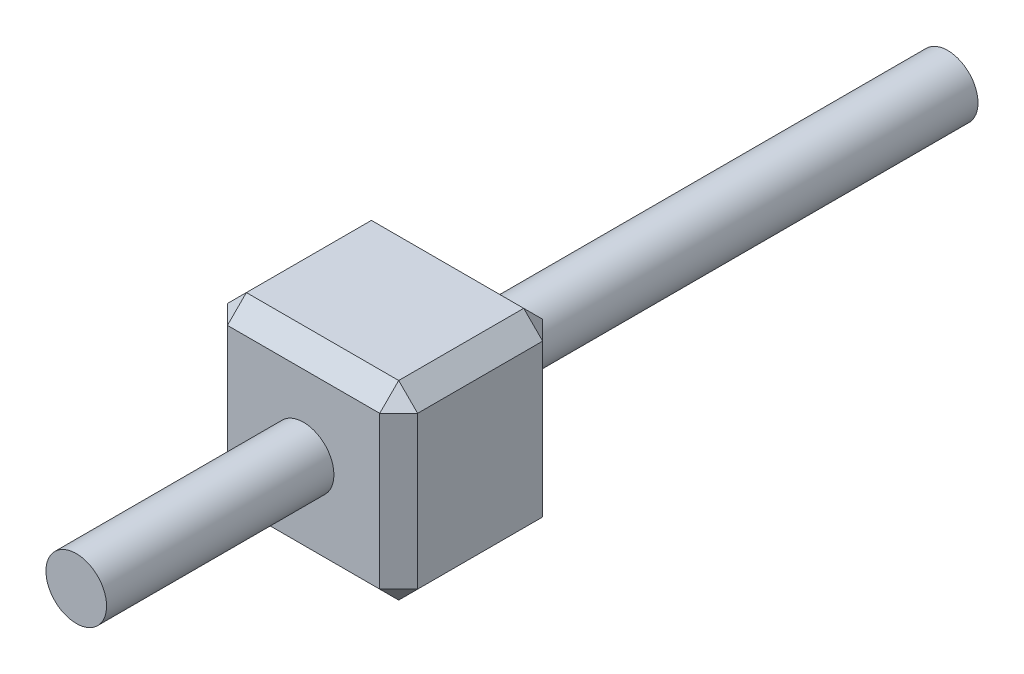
ISO-10303-21;
HEADER;
FILE_DESCRIPTION(('STEP AP214'),'2;1');
FILE_NAME('part.step','',(''),(''),'','','');
FILE_SCHEMA(('AUTOMOTIVE_DESIGN { 1 0 10303 214 1 1 1 1 }'));
ENDSEC;
DATA;
#1=APPLICATION_CONTEXT('core data for automotive mechanical design processes');
#2=APPLICATION_PROTOCOL_DEFINITION('international standard','automotive_design',2000,#1);
#3=PRODUCT_CONTEXT('',#1,'mechanical');
#4=PRODUCT('Part','Part','',(#3));
#5=PRODUCT_RELATED_PRODUCT_CATEGORY('part','',(#4));
#6=PRODUCT_DEFINITION_FORMATION('','',#4);
#7=PRODUCT_DEFINITION_CONTEXT('part definition',#1,'design');
#8=PRODUCT_DEFINITION('design','',#6,#7);
#9=PRODUCT_DEFINITION_SHAPE('','',#8);
#10=(LENGTH_UNIT() NAMED_UNIT(*) SI_UNIT(.MILLI.,.METRE.));
#11=(NAMED_UNIT(*) PLANE_ANGLE_UNIT() SI_UNIT($,.RADIAN.));
#12=(NAMED_UNIT(*) SI_UNIT($,.STERADIAN.) SOLID_ANGLE_UNIT());
#13=UNCERTAINTY_MEASURE_WITH_UNIT(LENGTH_MEASURE(1.E-05),#10,'distance_accuracy_value','');
#14=(GEOMETRIC_REPRESENTATION_CONTEXT(3) GLOBAL_UNCERTAINTY_ASSIGNED_CONTEXT((#13)) GLOBAL_UNIT_ASSIGNED_CONTEXT((#10,
#11,#12)) REPRESENTATION_CONTEXT('',''));
#15=CARTESIAN_POINT('',(0.,0.,0.));
#16=DIRECTION('',(0.,0.,1.));
#17=DIRECTION('',(1.,0.,0.));
#18=AXIS2_PLACEMENT_3D('',#15,#16,#17);
#19=CARTESIAN_POINT('',(-30.5004152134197,21.8097143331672,2.15));
#20=DIRECTION('',(0.,0.,1.));
#21=DIRECTION('',(1.,0.,0.));
#22=AXIS2_PLACEMENT_3D('',#19,#20,#21);
#23=PLANE('',#22);
#24=DIRECTION('',(-1.,0.,0.));
#25=VECTOR('',#24,1.);
#26=CARTESIAN_POINT('',(-30.5004152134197,24.0697143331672,2.15));
#27=LINE('',#26,#25);
#28=CARTESIAN_POINT('',(-28.2404152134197,24.0697143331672,2.15));
#29=VERTEX_POINT('',#28);
#30=CARTESIAN_POINT('',(-30.2504152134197,24.0697143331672,2.15));
#31=VERTEX_POINT('',#30);
#32=EDGE_CURVE('E123',#29,#31,#27,.T.);
#33=ORIENTED_EDGE('',*,*,#32,.T.);
#34=DIRECTION('',(0.,-1.,0.));
#35=VECTOR('',#34,1.);
#36=CARTESIAN_POINT('',(-30.2504152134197,21.8097143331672,2.15));
#37=LINE('',#36,#35);
#38=CARTESIAN_POINT('',(-30.2504152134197,22.0597143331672,2.15));
#39=VERTEX_POINT('',#38);
#40=EDGE_CURVE('E162',#31,#39,#37,.T.);
#41=ORIENTED_EDGE('',*,*,#40,.T.);
#42=DIRECTION('',(1.,0.,0.));
#43=VECTOR('',#42,1.);
#44=CARTESIAN_POINT('',(-27.9904152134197,22.0597143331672,2.15));
#45=LINE('',#44,#43);
#46=CARTESIAN_POINT('',(-28.2404152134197,22.0597143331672,2.15));
#47=VERTEX_POINT('',#46);
#48=EDGE_CURVE('E126',#39,#47,#45,.T.);
#49=ORIENTED_EDGE('',*,*,#48,.T.);
#50=DIRECTION('',(0.,1.,0.));
#51=VECTOR('',#50,1.);
#52=CARTESIAN_POINT('',(-28.2404152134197,24.3197143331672,2.15));
#53=LINE('',#52,#51);
#54=EDGE_CURVE('E118',#47,#29,#53,.T.);
#55=ORIENTED_EDGE('',*,*,#54,.T.);
#56=EDGE_LOOP('',(#33,#41,#49,#55));
#57=FACE_BOUND('',#56,.T.);
#58=CARTESIAN_POINT('',(-29.2454152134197,23.0647143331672,2.15));
#59=DIRECTION('',(0.,0.,1.));
#60=DIRECTION('',(1.,0.,0.));
#61=AXIS2_PLACEMENT_3D('',#58,#59,#60);
#62=CIRCLE('',#61,0.400000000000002);
#63=CARTESIAN_POINT('',(-28.8454152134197,23.0647143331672,2.15));
#64=VERTEX_POINT('',#63);
#65=EDGE_CURVE('E157',#64,#64,#62,.F.);
#66=ORIENTED_EDGE('',*,*,#65,.T.);
#67=EDGE_LOOP('',(#66));
#68=FACE_BOUND('',#67,.T.);
#69=ADVANCED_FACE('F33',(#57,#68),#23,.T.);
#70=CARTESIAN_POINT('',(-30.5004152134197,21.8097143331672,0.));
#71=DIRECTION('',(0.,0.,1.));
#72=DIRECTION('',(1.,0.,0.));
#73=AXIS2_PLACEMENT_3D('',#70,#71,#72);
#74=PLANE('',#73);
#75=DIRECTION('',(-1.,0.,0.));
#76=VECTOR('',#75,1.);
#77=CARTESIAN_POINT('',(-30.5004152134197,22.0597143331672,0.));
#78=LINE('',#77,#76);
#79=CARTESIAN_POINT('',(-28.2404152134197,22.0597143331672,0.));
#80=VERTEX_POINT('',#79);
#81=CARTESIAN_POINT('',(-30.2504152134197,22.0597143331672,0.));
#82=VERTEX_POINT('',#81);
#83=EDGE_CURVE('E177',#80,#82,#78,.T.);
#84=ORIENTED_EDGE('',*,*,#83,.T.);
#85=DIRECTION('',(0.,1.,0.));
#86=VECTOR('',#85,1.);
#87=CARTESIAN_POINT('',(-30.2504152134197,21.8097143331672,0.));
#88=LINE('',#87,#86);
#89=CARTESIAN_POINT('',(-30.2504152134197,24.0697143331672,0.));
#90=VERTEX_POINT('',#89);
#91=EDGE_CURVE('E179',#82,#90,#88,.T.);
#92=ORIENTED_EDGE('',*,*,#91,.T.);
#93=DIRECTION('',(1.,0.,0.));
#94=VECTOR('',#93,1.);
#95=CARTESIAN_POINT('',(-30.5004152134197,24.0697143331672,0.));
#96=LINE('',#95,#94);
#97=CARTESIAN_POINT('',(-28.2404152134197,24.0697143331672,0.));
#98=VERTEX_POINT('',#97);
#99=EDGE_CURVE('E173',#90,#98,#96,.T.);
#100=ORIENTED_EDGE('',*,*,#99,.T.);
#101=DIRECTION('',(0.,-1.,0.));
#102=VECTOR('',#101,1.);
#103=CARTESIAN_POINT('',(-28.2404152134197,21.8097143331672,0.));
#104=LINE('',#103,#102);
#105=EDGE_CURVE('E175',#98,#80,#104,.T.);
#106=ORIENTED_EDGE('',*,*,#105,.T.);
#107=EDGE_LOOP('',(#84,#92,#100,#106));
#108=FACE_BOUND('',#107,.T.);
#109=CARTESIAN_POINT('',(-29.2454152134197,23.0647143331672,0.));
#110=DIRECTION('',(0.,0.,1.));
#111=DIRECTION('',(1.,0.,0.));
#112=AXIS2_PLACEMENT_3D('',#109,#110,#111);
#113=CIRCLE('',#112,0.400000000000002);
#114=CARTESIAN_POINT('',(-28.8454152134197,23.0647143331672,0.));
#115=VERTEX_POINT('',#114);
#116=EDGE_CURVE('E154',#115,#115,#113,.F.);
#117=ORIENTED_EDGE('',*,*,#116,.F.);
#118=EDGE_LOOP('',(#117));
#119=FACE_BOUND('',#118,.T.);
#120=ADVANCED_FACE('F295',(#108,#119),#74,.F.);
#121=CARTESIAN_POINT('',(-30.5004152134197,24.3197143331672,2.15));
#122=DIRECTION('',(1.,0.,0.));
#123=DIRECTION('',(0.,0.,-1.));
#124=AXIS2_PLACEMENT_3D('',#121,#122,#123);
#125=PLANE('',#124);
#126=DIRECTION('',(0.,-1.,0.));
#127=VECTOR('',#126,1.);
#128=CARTESIAN_POINT('',(-30.5004152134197,24.3197143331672,0.25));
#129=LINE('',#128,#127);
#130=CARTESIAN_POINT('',(-30.5004152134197,24.0697143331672,0.25));
#131=VERTEX_POINT('',#130);
#132=CARTESIAN_POINT('',(-30.5004152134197,22.0597143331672,0.25));
#133=VERTEX_POINT('',#132);
#134=EDGE_CURVE('E166',#131,#133,#129,.T.);
#135=ORIENTED_EDGE('',*,*,#134,.T.);
#136=DIRECTION('',(0.,0.,1.));
#137=VECTOR('',#136,1.);
#138=CARTESIAN_POINT('',(-30.5004152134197,22.0597143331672,2.15));
#139=LINE('',#138,#137);
#140=CARTESIAN_POINT('',(-30.5004152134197,22.0597143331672,1.9));
#141=VERTEX_POINT('',#140);
#142=EDGE_CURVE('E171',#133,#141,#139,.T.);
#143=ORIENTED_EDGE('',*,*,#142,.T.);
#144=DIRECTION('',(0.,1.,0.));
#145=VECTOR('',#144,1.);
#146=CARTESIAN_POINT('',(-30.5004152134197,24.3197143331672,1.9));
#147=LINE('',#146,#145);
#148=CARTESIAN_POINT('',(-30.5004152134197,24.0697143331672,1.9));
#149=VERTEX_POINT('',#148);
#150=EDGE_CURVE('E168',#141,#149,#147,.T.);
#151=ORIENTED_EDGE('',*,*,#150,.T.);
#152=DIRECTION('',(0.,0.,-1.));
#153=VECTOR('',#152,1.);
#154=CARTESIAN_POINT('',(-30.5004152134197,24.0697143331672,2.15));
#155=LINE('',#154,#153);
#156=EDGE_CURVE('E164',#149,#131,#155,.T.);
#157=ORIENTED_EDGE('',*,*,#156,.T.);
#158=EDGE_LOOP('',(#135,#143,#151,#157));
#159=FACE_BOUND('',#158,.T.);
#160=ADVANCED_FACE('F35',(#159),#125,.F.);
#161=CARTESIAN_POINT('',(-30.5004152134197,21.8097143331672,2.15));
#162=DIRECTION('',(0.,1.,0.));
#163=DIRECTION('',(0.,0.,1.));
#164=AXIS2_PLACEMENT_3D('',#161,#162,#163);
#165=PLANE('',#164);
#166=DIRECTION('',(-1.,0.,0.));
#167=VECTOR('',#166,1.);
#168=CARTESIAN_POINT('',(-30.5004152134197,21.8097143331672,1.9));
#169=LINE('',#168,#167);
#170=CARTESIAN_POINT('',(-28.2404152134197,21.8097143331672,1.9));
#171=VERTEX_POINT('',#170);
#172=CARTESIAN_POINT('',(-30.2504152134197,21.8097143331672,1.9));
#173=VERTEX_POINT('',#172);
#174=EDGE_CURVE('E186',#171,#173,#169,.T.);
#175=ORIENTED_EDGE('',*,*,#174,.T.);
#176=DIRECTION('',(0.,0.,-1.));
#177=VECTOR('',#176,1.);
#178=CARTESIAN_POINT('',(-30.2504152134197,21.8097143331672,2.15));
#179=LINE('',#178,#177);
#180=CARTESIAN_POINT('',(-30.2504152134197,21.8097143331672,0.25));
#181=VERTEX_POINT('',#180);
#182=EDGE_CURVE('E188',#173,#181,#179,.T.);
#183=ORIENTED_EDGE('',*,*,#182,.T.);
#184=DIRECTION('',(1.,0.,0.));
#185=VECTOR('',#184,1.);
#186=CARTESIAN_POINT('',(-30.5004152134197,21.8097143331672,0.25));
#187=LINE('',#186,#185);
#188=CARTESIAN_POINT('',(-28.2404152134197,21.8097143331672,0.25));
#189=VERTEX_POINT('',#188);
#190=EDGE_CURVE('E184',#181,#189,#187,.T.);
#191=ORIENTED_EDGE('',*,*,#190,.T.);
#192=DIRECTION('',(0.,0.,1.));
#193=VECTOR('',#192,1.);
#194=CARTESIAN_POINT('',(-28.2404152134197,21.8097143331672,2.15));
#195=LINE('',#194,#193);
#196=EDGE_CURVE('E182',#189,#171,#195,.T.);
#197=ORIENTED_EDGE('',*,*,#196,.T.);
#198=EDGE_LOOP('',(#175,#183,#191,#197));
#199=FACE_BOUND('',#198,.T.);
#200=ADVANCED_FACE('F308',(#199),#165,.F.);
#201=CARTESIAN_POINT('',(-27.9904152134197,24.3197143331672,2.15));
#202=DIRECTION('',(-1.,0.,0.));
#203=DIRECTION('',(0.,-1.,0.));
#204=AXIS2_PLACEMENT_3D('',#201,#202,#203);
#205=PLANE('',#204);
#206=DIRECTION('',(0.,-1.,0.));
#207=VECTOR('',#206,1.);
#208=CARTESIAN_POINT('',(-27.9904152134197,21.8097143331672,1.9));
#209=LINE('',#208,#207);
#210=CARTESIAN_POINT('',(-27.9904152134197,24.0697143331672,1.9));
#211=VERTEX_POINT('',#210);
#212=CARTESIAN_POINT('',(-27.9904152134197,22.0597143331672,1.9));
#213=VERTEX_POINT('',#212);
#214=EDGE_CURVE('E136',#211,#213,#209,.T.);
#215=ORIENTED_EDGE('',*,*,#214,.T.);
#216=DIRECTION('',(0.,0.,-1.));
#217=VECTOR('',#216,1.);
#218=CARTESIAN_POINT('',(-27.9904152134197,22.0597143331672,2.15));
#219=LINE('',#218,#217);
#220=CARTESIAN_POINT('',(-27.9904152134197,22.0597143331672,0.25));
#221=VERTEX_POINT('',#220);
#222=EDGE_CURVE('E196',#213,#221,#219,.T.);
#223=ORIENTED_EDGE('',*,*,#222,.T.);
#224=DIRECTION('',(0.,1.,0.));
#225=VECTOR('',#224,1.);
#226=CARTESIAN_POINT('',(-27.9904152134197,24.3197143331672,0.25));
#227=LINE('',#226,#225);
#228=CARTESIAN_POINT('',(-27.9904152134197,24.0697143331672,0.25));
#229=VERTEX_POINT('',#228);
#230=EDGE_CURVE('E193',#221,#229,#227,.T.);
#231=ORIENTED_EDGE('',*,*,#230,.T.);
#232=DIRECTION('',(0.,0.,1.));
#233=VECTOR('',#232,1.);
#234=CARTESIAN_POINT('',(-27.9904152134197,24.0697143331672,2.15));
#235=LINE('',#234,#233);
#236=EDGE_CURVE('E191',#229,#211,#235,.T.);
#237=ORIENTED_EDGE('',*,*,#236,.T.);
#238=EDGE_LOOP('',(#215,#223,#231,#237));
#239=FACE_BOUND('',#238,.T.);
#240=ADVANCED_FACE('F306',(#239),#205,.F.);
#241=CARTESIAN_POINT('',(-30.5004152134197,24.3197143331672,2.15));
#242=DIRECTION('',(0.,-1.,0.));
#243=DIRECTION('',(0.,0.,-1.));
#244=AXIS2_PLACEMENT_3D('',#241,#242,#243);
#245=PLANE('',#244);
#246=DIRECTION('',(1.,0.,0.));
#247=VECTOR('',#246,1.);
#248=CARTESIAN_POINT('',(-27.9904152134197,24.3197143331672,1.9));
#249=LINE('',#248,#247);
#250=CARTESIAN_POINT('',(-30.2504152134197,24.3197143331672,1.9));
#251=VERTEX_POINT('',#250);
#252=CARTESIAN_POINT('',(-28.2404152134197,24.3197143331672,1.9));
#253=VERTEX_POINT('',#252);
#254=EDGE_CURVE('E41',#251,#253,#249,.T.);
#255=ORIENTED_EDGE('',*,*,#254,.T.);
#256=DIRECTION('',(0.,0.,-1.));
#257=VECTOR('',#256,1.);
#258=CARTESIAN_POINT('',(-28.2404152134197,24.3197143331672,2.15));
#259=LINE('',#258,#257);
#260=CARTESIAN_POINT('',(-28.2404152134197,24.3197143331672,0.25));
#261=VERTEX_POINT('',#260);
#262=EDGE_CURVE('E11',#253,#261,#259,.T.);
#263=ORIENTED_EDGE('',*,*,#262,.T.);
#264=DIRECTION('',(-1.,0.,0.));
#265=VECTOR('',#264,1.);
#266=CARTESIAN_POINT('',(-30.5004152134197,24.3197143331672,0.25));
#267=LINE('',#266,#265);
#268=CARTESIAN_POINT('',(-30.2504152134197,24.3197143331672,0.25));
#269=VERTEX_POINT('',#268);
#270=EDGE_CURVE('E199',#261,#269,#267,.T.);
#271=ORIENTED_EDGE('',*,*,#270,.T.);
#272=DIRECTION('',(0.,0.,1.));
#273=VECTOR('',#272,1.);
#274=CARTESIAN_POINT('',(-30.2504152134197,24.3197143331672,2.15));
#275=LINE('',#274,#273);
#276=EDGE_CURVE('E51',#269,#251,#275,.T.);
#277=ORIENTED_EDGE('',*,*,#276,.T.);
#278=EDGE_LOOP('',(#255,#263,#271,#277));
#279=FACE_BOUND('',#278,.T.);
#280=ADVANCED_FACE('F202',(#279),#245,.F.);
#281=CARTESIAN_POINT('',(-29.2454152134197,23.0647143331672,-6.35));
#282=DIRECTION('',(0.,0.,1.));
#283=DIRECTION('',(1.,0.,0.));
#284=AXIS2_PLACEMENT_3D('',#281,#282,#283);
#285=PLANE('',#284);
#286=CARTESIAN_POINT('',(-29.2454152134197,23.0647143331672,-6.35));
#287=DIRECTION('',(0.,0.,1.));
#288=DIRECTION('',(1.,0.,0.));
#289=AXIS2_PLACEMENT_3D('',#286,#287,#288);
#290=CIRCLE('',#289,0.400000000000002);
#291=CARTESIAN_POINT('',(-28.8454152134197,23.0647143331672,-6.35));
#292=VERTEX_POINT('',#291);
#293=EDGE_CURVE('E268',#292,#292,#290,.T.);
#294=ORIENTED_EDGE('',*,*,#293,.F.);
#295=EDGE_LOOP('',(#294));
#296=FACE_BOUND('',#295,.T.);
#297=ADVANCED_FACE('F305',(#296),#285,.F.);
#298=CARTESIAN_POINT('',(-29.2454152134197,23.0647143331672,5.15));
#299=DIRECTION('',(0.,0.,-1.));
#300=DIRECTION('',(-1.,0.,0.));
#301=AXIS2_PLACEMENT_3D('',#298,#299,#300);
#302=CYLINDRICAL_SURFACE('',#301,0.400000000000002);
#303=ORIENTED_EDGE('',*,*,#293,.T.);
#304=EDGE_LOOP('',(#303));
#305=FACE_BOUND('',#304,.T.);
#306=ORIENTED_EDGE('',*,*,#116,.T.);
#307=EDGE_LOOP('',(#306));
#308=FACE_BOUND('',#307,.T.);
#309=ADVANCED_FACE('F280',(#305,#308),#302,.T.);
#310=ORIENTED_EDGE('',*,*,#65,.F.);
#311=EDGE_LOOP('',(#310));
#312=FACE_BOUND('',#311,.T.);
#313=CARTESIAN_POINT('',(-29.2454152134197,23.0647143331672,5.15));
#314=DIRECTION('',(0.,0.,1.));
#315=DIRECTION('',(1.,0.,0.));
#316=AXIS2_PLACEMENT_3D('',#313,#314,#315);
#317=CIRCLE('',#316,0.400000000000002);
#318=CARTESIAN_POINT('',(-28.8454152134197,23.0647143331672,5.15));
#319=VERTEX_POINT('',#318);
#320=EDGE_CURVE('E271',#319,#319,#317,.T.);
#321=ORIENTED_EDGE('',*,*,#320,.F.);
#322=EDGE_LOOP('',(#321));
#323=FACE_BOUND('',#322,.T.);
#324=ADVANCED_FACE('F276',(#312,#323),#302,.T.);
#325=CARTESIAN_POINT('',(-29.2454152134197,23.0647143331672,5.15));
#326=DIRECTION('',(0.,0.,1.));
#327=DIRECTION('',(1.,0.,0.));
#328=AXIS2_PLACEMENT_3D('',#325,#326,#327);
#329=PLANE('',#328);
#330=ORIENTED_EDGE('',*,*,#320,.T.);
#331=EDGE_LOOP('',(#330));
#332=FACE_BOUND('',#331,.T.);
#333=ADVANCED_FACE('F279',(#332),#329,.T.);
#334=CARTESIAN_POINT('',(-27.9904152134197,24.3197143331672,0.25));
#335=DIRECTION('',(-0.707106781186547,0.,0.707106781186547));
#336=DIRECTION('',(0.707106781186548,0.,0.707106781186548));
#337=AXIS2_PLACEMENT_3D('',#334,#335,#336);
#338=PLANE('',#337);
#339=DIRECTION('',(0.707106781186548,0.,0.707106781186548));
#340=VECTOR('',#339,1.);
#341=CARTESIAN_POINT('',(-27.9904152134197,24.0697143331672,0.25));
#342=LINE('',#341,#340);
#343=EDGE_CURVE('E265',#229,#98,#342,.F.);
#344=ORIENTED_EDGE('',*,*,#343,.F.);
#345=ORIENTED_EDGE('',*,*,#230,.F.);
#346=DIRECTION('',(-0.707106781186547,0.,-0.707106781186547));
#347=VECTOR('',#346,1.);
#348=CARTESIAN_POINT('',(-28.1154152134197,22.0597143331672,0.125));
#349=LINE('',#348,#347);
#350=EDGE_CURVE('E262',#80,#221,#349,.F.);
#351=ORIENTED_EDGE('',*,*,#350,.F.);
#352=ORIENTED_EDGE('',*,*,#105,.F.);
#353=EDGE_LOOP('',(#344,#345,#351,#352));
#354=FACE_BOUND('',#353,.T.);
#355=ADVANCED_FACE('F285',(#354),#338,.F.);
#356=CARTESIAN_POINT('',(-27.9904152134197,24.0697143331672,0.25));
#357=DIRECTION('',(0.577350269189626,0.577350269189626,-0.577350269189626));
#358=DIRECTION('',(-0.707106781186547,0.,-0.707106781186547));
#359=AXIS2_PLACEMENT_3D('',#356,#357,#358);
#360=PLANE('',#359);
#361=DIRECTION('',(-0.707106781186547,0.707106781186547,0.));
#362=VECTOR('',#361,1.);
#363=CARTESIAN_POINT('',(-27.9904152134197,24.0697143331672,0.25));
#364=LINE('',#363,#362);
#365=EDGE_CURVE('E257',#229,#261,#364,.T.);
#366=ORIENTED_EDGE('',*,*,#365,.F.);
#367=ORIENTED_EDGE('',*,*,#343,.T.);
#368=DIRECTION('',(0.,-0.707106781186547,-0.707106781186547));
#369=VECTOR('',#368,1.);
#370=CARTESIAN_POINT('',(-28.2404152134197,24.1947143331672,0.125));
#371=LINE('',#370,#369);
#372=EDGE_CURVE('E260',#261,#98,#371,.T.);
#373=ORIENTED_EDGE('',*,*,#372,.F.);
#374=EDGE_LOOP('',(#366,#367,#373));
#375=FACE_BOUND('',#374,.T.);
#376=ADVANCED_FACE('F290',(#375),#360,.T.);
#377=CARTESIAN_POINT('',(-28.2404152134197,21.8097143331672,0.25));
#378=DIRECTION('',(0.577350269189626,-0.577350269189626,-0.577350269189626));
#379=DIRECTION('',(-0.707106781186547,0.,-0.707106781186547));
#380=AXIS2_PLACEMENT_3D('',#377,#378,#379);
#381=PLANE('',#380);
#382=DIRECTION('',(0.,-0.707106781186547,0.707106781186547));
#383=VECTOR('',#382,1.);
#384=CARTESIAN_POINT('',(-28.2404152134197,21.8097143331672,0.25));
#385=LINE('',#384,#383);
#386=EDGE_CURVE('E252',#80,#189,#385,.T.);
#387=ORIENTED_EDGE('',*,*,#386,.F.);
#388=ORIENTED_EDGE('',*,*,#350,.T.);
#389=DIRECTION('',(0.707106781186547,0.707106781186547,0.));
#390=VECTOR('',#389,1.);
#391=CARTESIAN_POINT('',(-28.2404152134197,21.8097143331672,0.25));
#392=LINE('',#391,#390);
#393=EDGE_CURVE('E255',#189,#221,#392,.T.);
#394=ORIENTED_EDGE('',*,*,#393,.F.);
#395=EDGE_LOOP('',(#387,#388,#394));
#396=FACE_BOUND('',#395,.T.);
#397=ADVANCED_FACE('F353',(#396),#381,.T.);
#398=CARTESIAN_POINT('',(-30.5004152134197,24.3197143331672,0.25));
#399=DIRECTION('',(0.,-0.707106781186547,0.707106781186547));
#400=DIRECTION('',(0.,-0.707106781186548,-0.707106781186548));
#401=AXIS2_PLACEMENT_3D('',#398,#399,#400);
#402=PLANE('',#401);
#403=ORIENTED_EDGE('',*,*,#372,.T.);
#404=ORIENTED_EDGE('',*,*,#99,.F.);
#405=DIRECTION('',(0.,0.707106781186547,0.707106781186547));
#406=VECTOR('',#405,1.);
#407=CARTESIAN_POINT('',(-30.2504152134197,24.0697143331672,0.));
#408=LINE('',#407,#406);
#409=EDGE_CURVE('E207',#269,#90,#408,.F.);
#410=ORIENTED_EDGE('',*,*,#409,.F.);
#411=ORIENTED_EDGE('',*,*,#270,.F.);
#412=EDGE_LOOP('',(#403,#404,#410,#411));
#413=FACE_BOUND('',#412,.T.);
#414=ADVANCED_FACE('F209',(#413),#402,.F.);
#415=CARTESIAN_POINT('',(-28.2404152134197,24.3197143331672,2.15));
#416=DIRECTION('',(-0.707106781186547,-0.707106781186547,0.));
#417=DIRECTION('',(0.707106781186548,-0.707106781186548,0.));
#418=AXIS2_PLACEMENT_3D('',#415,#416,#417);
#419=PLANE('',#418);
#420=ORIENTED_EDGE('',*,*,#365,.T.);
#421=ORIENTED_EDGE('',*,*,#262,.F.);
#422=DIRECTION('',(0.707106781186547,-0.707106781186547,0.));
#423=VECTOR('',#422,1.);
#424=CARTESIAN_POINT('',(-28.1154152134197,24.1947143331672,1.9));
#425=LINE('',#424,#423);
#426=EDGE_CURVE('E140',#211,#253,#425,.F.);
#427=ORIENTED_EDGE('',*,*,#426,.F.);
#428=ORIENTED_EDGE('',*,*,#236,.F.);
#429=EDGE_LOOP('',(#420,#421,#427,#428));
#430=FACE_BOUND('',#429,.T.);
#431=ADVANCED_FACE('F382',(#430),#419,.F.);
#432=CARTESIAN_POINT('',(-28.2404152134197,21.8097143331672,2.15));
#433=DIRECTION('',(0.707106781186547,0.,0.707106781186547));
#434=DIRECTION('',(0.707106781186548,0.,-0.707106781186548));
#435=AXIS2_PLACEMENT_3D('',#432,#433,#434);
#436=PLANE('',#435);
#437=DIRECTION('',(-0.707106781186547,0.,0.707106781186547));
#438=VECTOR('',#437,1.);
#439=CARTESIAN_POINT('',(-28.2404152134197,22.0597143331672,2.15));
#440=LINE('',#439,#438);
#441=EDGE_CURVE('E141',#213,#47,#440,.T.);
#442=ORIENTED_EDGE('',*,*,#441,.F.);
#443=ORIENTED_EDGE('',*,*,#214,.F.);
#444=DIRECTION('',(0.707106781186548,0.,-0.707106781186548));
#445=VECTOR('',#444,1.);
#446=CARTESIAN_POINT('',(-28.2404152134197,24.0697143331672,2.15));
#447=LINE('',#446,#445);
#448=EDGE_CURVE('E133',#29,#211,#447,.T.);
#449=ORIENTED_EDGE('',*,*,#448,.F.);
#450=ORIENTED_EDGE('',*,*,#54,.F.);
#451=EDGE_LOOP('',(#442,#443,#449,#450));
#452=FACE_BOUND('',#451,.T.);
#453=ADVANCED_FACE('F135',(#452),#436,.T.);
#454=CARTESIAN_POINT('',(-27.9904152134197,22.0597143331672,2.15));
#455=DIRECTION('',(-0.707106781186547,0.707106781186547,0.));
#456=DIRECTION('',(-0.707106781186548,-0.707106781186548,0.));
#457=AXIS2_PLACEMENT_3D('',#454,#455,#456);
#458=PLANE('',#457);
#459=ORIENTED_EDGE('',*,*,#393,.T.);
#460=ORIENTED_EDGE('',*,*,#222,.F.);
#461=DIRECTION('',(-0.707106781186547,-0.707106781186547,0.));
#462=VECTOR('',#461,1.);
#463=CARTESIAN_POINT('',(-28.1154152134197,21.9347143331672,1.9));
#464=LINE('',#463,#462);
#465=EDGE_CURVE('E246',#171,#213,#464,.F.);
#466=ORIENTED_EDGE('',*,*,#465,.F.);
#467=ORIENTED_EDGE('',*,*,#196,.F.);
#468=EDGE_LOOP('',(#459,#460,#466,#467));
#469=FACE_BOUND('',#468,.T.);
#470=ADVANCED_FACE('F358',(#469),#458,.F.);
#471=CARTESIAN_POINT('',(-30.5004152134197,21.8097143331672,0.25));
#472=DIRECTION('',(0.,0.707106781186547,0.707106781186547));
#473=DIRECTION('',(0.,-0.707106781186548,0.707106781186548));
#474=AXIS2_PLACEMENT_3D('',#471,#472,#473);
#475=PLANE('',#474);
#476=ORIENTED_EDGE('',*,*,#386,.T.);
#477=ORIENTED_EDGE('',*,*,#190,.F.);
#478=DIRECTION('',(0.,0.707106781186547,-0.707106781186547));
#479=VECTOR('',#478,1.);
#480=CARTESIAN_POINT('',(-30.2504152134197,21.9347143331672,0.125));
#481=LINE('',#480,#479);
#482=EDGE_CURVE('E243',#82,#181,#481,.F.);
#483=ORIENTED_EDGE('',*,*,#482,.F.);
#484=ORIENTED_EDGE('',*,*,#83,.F.);
#485=EDGE_LOOP('',(#476,#477,#483,#484));
#486=FACE_BOUND('',#485,.T.);
#487=ADVANCED_FACE('F349',(#486),#475,.F.);
#488=CARTESIAN_POINT('',(-30.5004152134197,24.3197143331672,0.25));
#489=DIRECTION('',(0.707106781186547,0.,0.707106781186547));
#490=DIRECTION('',(0.707106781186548,0.,-0.707106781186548));
#491=AXIS2_PLACEMENT_3D('',#488,#489,#490);
#492=PLANE('',#491);
#493=DIRECTION('',(0.707106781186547,0.,-0.707106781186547));
#494=VECTOR('',#493,1.);
#495=CARTESIAN_POINT('',(-30.2504152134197,24.0697143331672,0.));
#496=LINE('',#495,#494);
#497=EDGE_CURVE('E213',#90,#131,#496,.F.);
#498=ORIENTED_EDGE('',*,*,#497,.F.);
#499=ORIENTED_EDGE('',*,*,#91,.F.);
#500=DIRECTION('',(-0.707106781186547,0.,0.707106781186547));
#501=VECTOR('',#500,1.);
#502=CARTESIAN_POINT('',(-30.5004152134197,22.0597143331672,0.25));
#503=LINE('',#502,#501);
#504=EDGE_CURVE('E219',#133,#82,#503,.F.);
#505=ORIENTED_EDGE('',*,*,#504,.F.);
#506=ORIENTED_EDGE('',*,*,#134,.F.);
#507=EDGE_LOOP('',(#498,#499,#505,#506));
#508=FACE_BOUND('',#507,.T.);
#509=ADVANCED_FACE('F342',(#508),#492,.F.);
#510=CARTESIAN_POINT('',(-30.2504152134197,24.0697143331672,0.));
#511=DIRECTION('',(-0.577350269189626,0.577350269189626,-0.577350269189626));
#512=DIRECTION('',(-0.707106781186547,0.,0.707106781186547));
#513=AXIS2_PLACEMENT_3D('',#510,#511,#512);
#514=PLANE('',#513);
#515=ORIENTED_EDGE('',*,*,#409,.T.);
#516=ORIENTED_EDGE('',*,*,#497,.T.);
#517=DIRECTION('',(-0.707106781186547,-0.707106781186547,0.));
#518=VECTOR('',#517,1.);
#519=CARTESIAN_POINT('',(-30.3754152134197,24.1947143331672,0.25));
#520=LINE('',#519,#518);
#521=EDGE_CURVE('E147',#269,#131,#520,.T.);
#522=ORIENTED_EDGE('',*,*,#521,.F.);
#523=EDGE_LOOP('',(#515,#516,#522));
#524=FACE_BOUND('',#523,.T.);
#525=ADVANCED_FACE('F216',(#524),#514,.T.);
#526=CARTESIAN_POINT('',(-28.2404152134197,24.0697143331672,2.15));
#527=DIRECTION('',(0.577350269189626,0.577350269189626,0.577350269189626));
#528=DIRECTION('',(0.707106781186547,0.,-0.707106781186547));
#529=AXIS2_PLACEMENT_3D('',#526,#527,#528);
#530=PLANE('',#529);
#531=ORIENTED_EDGE('',*,*,#448,.T.);
#532=ORIENTED_EDGE('',*,*,#426,.T.);
#533=DIRECTION('',(0.,-0.707106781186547,0.707106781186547));
#534=VECTOR('',#533,1.);
#535=CARTESIAN_POINT('',(-28.2404152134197,24.0697143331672,2.15));
#536=LINE('',#535,#534);
#537=EDGE_CURVE('E144',#29,#253,#536,.F.);
#538=ORIENTED_EDGE('',*,*,#537,.F.);
#539=EDGE_LOOP('',(#531,#532,#538));
#540=FACE_BOUND('',#539,.T.);
#541=ADVANCED_FACE('F145',(#540),#530,.T.);
#542=CARTESIAN_POINT('',(-28.2404152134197,22.0597143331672,2.15));
#543=DIRECTION('',(0.577350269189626,-0.577350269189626,0.577350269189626));
#544=DIRECTION('',(0.707106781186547,0.,-0.707106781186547));
#545=AXIS2_PLACEMENT_3D('',#542,#543,#544);
#546=PLANE('',#545);
#547=ORIENTED_EDGE('',*,*,#465,.T.);
#548=ORIENTED_EDGE('',*,*,#441,.T.);
#549=DIRECTION('',(0.,-0.707106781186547,-0.707106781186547));
#550=VECTOR('',#549,1.);
#551=CARTESIAN_POINT('',(-28.2404152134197,22.0597143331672,2.15));
#552=LINE('',#551,#550);
#553=EDGE_CURVE('E148',#171,#47,#552,.F.);
#554=ORIENTED_EDGE('',*,*,#553,.F.);
#555=EDGE_LOOP('',(#547,#548,#554));
#556=FACE_BOUND('',#555,.T.);
#557=ADVANCED_FACE('F361',(#556),#546,.T.);
#558=CARTESIAN_POINT('',(-30.5004152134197,22.0597143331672,0.25));
#559=DIRECTION('',(-0.577350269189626,-0.577350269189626,-0.577350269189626));
#560=DIRECTION('',(-0.707106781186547,0.,0.707106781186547));
#561=AXIS2_PLACEMENT_3D('',#558,#559,#560);
#562=PLANE('',#561);
#563=ORIENTED_EDGE('',*,*,#504,.T.);
#564=ORIENTED_EDGE('',*,*,#482,.T.);
#565=DIRECTION('',(0.707106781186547,-0.707106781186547,0.));
#566=VECTOR('',#565,1.);
#567=CARTESIAN_POINT('',(-30.5004152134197,22.0597143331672,0.25));
#568=LINE('',#567,#566);
#569=EDGE_CURVE('E226',#133,#181,#568,.T.);
#570=ORIENTED_EDGE('',*,*,#569,.F.);
#571=EDGE_LOOP('',(#563,#564,#570));
#572=FACE_BOUND('',#571,.T.);
#573=ADVANCED_FACE('F345',(#572),#562,.T.);
#574=CARTESIAN_POINT('',(-30.5004152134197,24.0697143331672,2.15));
#575=DIRECTION('',(0.707106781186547,-0.707106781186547,0.));
#576=DIRECTION('',(0.707106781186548,0.707106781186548,0.));
#577=AXIS2_PLACEMENT_3D('',#574,#575,#576);
#578=PLANE('',#577);
#579=ORIENTED_EDGE('',*,*,#521,.T.);
#580=ORIENTED_EDGE('',*,*,#156,.F.);
#581=DIRECTION('',(0.707106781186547,0.707106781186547,0.));
#582=VECTOR('',#581,1.);
#583=CARTESIAN_POINT('',(-30.5004152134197,24.0697143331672,1.9));
#584=LINE('',#583,#582);
#585=EDGE_CURVE('E224',#251,#149,#584,.F.);
#586=ORIENTED_EDGE('',*,*,#585,.F.);
#587=ORIENTED_EDGE('',*,*,#276,.F.);
#588=EDGE_LOOP('',(#579,#580,#586,#587));
#589=FACE_BOUND('',#588,.T.);
#590=ADVANCED_FACE('F222',(#589),#578,.F.);
#591=CARTESIAN_POINT('',(-30.5004152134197,24.0697143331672,2.15));
#592=DIRECTION('',(0.,0.707106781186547,0.707106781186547));
#593=DIRECTION('',(0.,-0.707106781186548,0.707106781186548));
#594=AXIS2_PLACEMENT_3D('',#591,#592,#593);
#595=PLANE('',#594);
#596=ORIENTED_EDGE('',*,*,#537,.T.);
#597=ORIENTED_EDGE('',*,*,#254,.F.);
#598=DIRECTION('',(0.,0.707106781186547,-0.707106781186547));
#599=VECTOR('',#598,1.);
#600=CARTESIAN_POINT('',(-30.2504152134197,24.1947143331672,2.025));
#601=LINE('',#600,#599);
#602=EDGE_CURVE('E152',#31,#251,#601,.T.);
#603=ORIENTED_EDGE('',*,*,#602,.F.);
#604=ORIENTED_EDGE('',*,*,#32,.F.);
#605=EDGE_LOOP('',(#596,#597,#603,#604));
#606=FACE_BOUND('',#605,.T.);
#607=ADVANCED_FACE('F150',(#606),#595,.T.);
#608=CARTESIAN_POINT('',(-30.5004152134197,22.0597143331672,2.15));
#609=DIRECTION('',(0.,-0.707106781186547,0.707106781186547));
#610=DIRECTION('',(0.,-0.707106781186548,-0.707106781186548));
#611=AXIS2_PLACEMENT_3D('',#608,#609,#610);
#612=PLANE('',#611);
#613=ORIENTED_EDGE('',*,*,#553,.T.);
#614=ORIENTED_EDGE('',*,*,#48,.F.);
#615=DIRECTION('',(0.,0.707106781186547,0.707106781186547));
#616=VECTOR('',#615,1.);
#617=CARTESIAN_POINT('',(-30.2504152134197,22.0597143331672,2.15));
#618=LINE('',#617,#616);
#619=EDGE_CURVE('E231',#173,#39,#618,.T.);
#620=ORIENTED_EDGE('',*,*,#619,.F.);
#621=ORIENTED_EDGE('',*,*,#174,.F.);
#622=EDGE_LOOP('',(#613,#614,#620,#621));
#623=FACE_BOUND('',#622,.T.);
#624=ADVANCED_FACE('F329',(#623),#612,.T.);
#625=CARTESIAN_POINT('',(-30.2504152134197,21.8097143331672,2.15));
#626=DIRECTION('',(0.707106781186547,0.707106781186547,0.));
#627=DIRECTION('',(-0.707106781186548,0.707106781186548,0.));
#628=AXIS2_PLACEMENT_3D('',#625,#626,#627);
#629=PLANE('',#628);
#630=ORIENTED_EDGE('',*,*,#569,.T.);
#631=ORIENTED_EDGE('',*,*,#182,.F.);
#632=DIRECTION('',(-0.707106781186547,0.707106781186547,0.));
#633=VECTOR('',#632,1.);
#634=CARTESIAN_POINT('',(-30.3754152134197,21.9347143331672,1.9));
#635=LINE('',#634,#633);
#636=EDGE_CURVE('E234',#141,#173,#635,.F.);
#637=ORIENTED_EDGE('',*,*,#636,.F.);
#638=ORIENTED_EDGE('',*,*,#142,.F.);
#639=EDGE_LOOP('',(#630,#631,#637,#638));
#640=FACE_BOUND('',#639,.T.);
#641=ADVANCED_FACE('F324',(#640),#629,.F.);
#642=CARTESIAN_POINT('',(-30.5004152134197,24.0697143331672,1.9));
#643=DIRECTION('',(-0.577350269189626,0.577350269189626,0.577350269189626));
#644=DIRECTION('',(0.707106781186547,0.,0.707106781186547));
#645=AXIS2_PLACEMENT_3D('',#642,#643,#644);
#646=PLANE('',#645);
#647=ORIENTED_EDGE('',*,*,#602,.T.);
#648=ORIENTED_EDGE('',*,*,#585,.T.);
#649=DIRECTION('',(0.707106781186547,0.,0.707106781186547));
#650=VECTOR('',#649,1.);
#651=CARTESIAN_POINT('',(-30.5004152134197,24.0697143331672,1.9));
#652=LINE('',#651,#650);
#653=EDGE_CURVE('E229',#31,#149,#652,.F.);
#654=ORIENTED_EDGE('',*,*,#653,.F.);
#655=EDGE_LOOP('',(#647,#648,#654));
#656=FACE_BOUND('',#655,.T.);
#657=ADVANCED_FACE('F228',(#656),#646,.T.);
#658=CARTESIAN_POINT('',(-30.2504152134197,22.0597143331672,2.15));
#659=DIRECTION('',(-0.577350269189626,-0.577350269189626,0.577350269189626));
#660=DIRECTION('',(0.707106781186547,0.,0.707106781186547));
#661=AXIS2_PLACEMENT_3D('',#658,#659,#660);
#662=PLANE('',#661);
#663=ORIENTED_EDGE('',*,*,#636,.T.);
#664=ORIENTED_EDGE('',*,*,#619,.T.);
#665=DIRECTION('',(-0.707106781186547,0.,-0.707106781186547));
#666=VECTOR('',#665,1.);
#667=CARTESIAN_POINT('',(-30.2504152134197,22.0597143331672,2.15));
#668=LINE('',#667,#666);
#669=EDGE_CURVE('E333',#141,#39,#668,.F.);
#670=ORIENTED_EDGE('',*,*,#669,.F.);
#671=EDGE_LOOP('',(#663,#664,#670));
#672=FACE_BOUND('',#671,.T.);
#673=ADVANCED_FACE('F332',(#672),#662,.T.);
#674=CARTESIAN_POINT('',(-30.2504152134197,21.8097143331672,2.15));
#675=DIRECTION('',(-0.707106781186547,0.,0.707106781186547));
#676=DIRECTION('',(0.707106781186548,0.,0.707106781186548));
#677=AXIS2_PLACEMENT_3D('',#674,#675,#676);
#678=PLANE('',#677);
#679=ORIENTED_EDGE('',*,*,#653,.T.);
#680=ORIENTED_EDGE('',*,*,#150,.F.);
#681=ORIENTED_EDGE('',*,*,#669,.T.);
#682=ORIENTED_EDGE('',*,*,#40,.F.);
#683=EDGE_LOOP('',(#679,#680,#681,#682));
#684=FACE_BOUND('',#683,.T.);
#685=ADVANCED_FACE('F337',(#684),#678,.T.);
#686=CLOSED_SHELL('',(#69,#120,#160,#200,#240,#280,#297,#309,#324,#333,#355,#376,#397,#414,#431,
#453,#470,#487,#509,#525,#541,#557,#573,#590,#607,#624,#641,#657,#673,#685));
#687=MANIFOLD_SOLID_BREP('B2',#686);
#688=ADVANCED_BREP_SHAPE_REPRESENTATION('',(#18,#687),#14);
#689=SHAPE_DEFINITION_REPRESENTATION(#9,#688);
ENDSEC;
END-ISO-10303-21;
